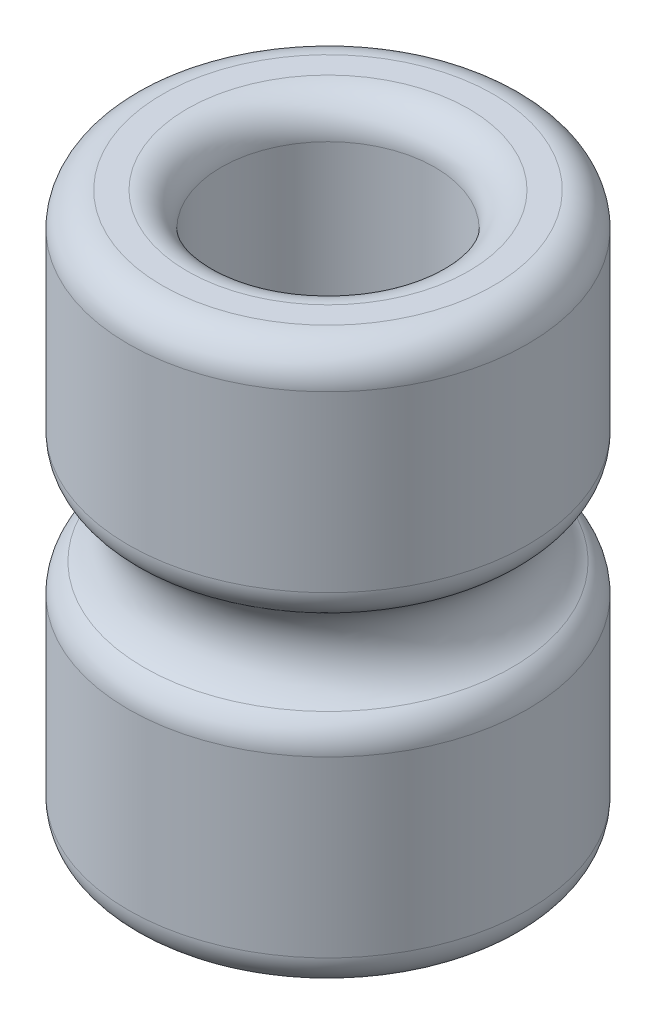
ISO-10303-21;
HEADER;
FILE_DESCRIPTION(('STEP AP214'),'2;1');
FILE_NAME('part.step','',(''),(''),'','','');
FILE_SCHEMA(('AUTOMOTIVE_DESIGN { 1 0 10303 214 1 1 1 1 }'));
ENDSEC;
DATA;
#1=APPLICATION_CONTEXT('core data for automotive mechanical design processes');
#2=APPLICATION_PROTOCOL_DEFINITION('international standard','automotive_design',2000,#1);
#3=PRODUCT_CONTEXT('',#1,'mechanical');
#4=PRODUCT('Part','Part','',(#3));
#5=PRODUCT_RELATED_PRODUCT_CATEGORY('part','',(#4));
#6=PRODUCT_DEFINITION_FORMATION('','',#4);
#7=PRODUCT_DEFINITION_CONTEXT('part definition',#1,'design');
#8=PRODUCT_DEFINITION('design','',#6,#7);
#9=PRODUCT_DEFINITION_SHAPE('','',#8);
#10=(LENGTH_UNIT() NAMED_UNIT(*) SI_UNIT(.MILLI.,.METRE.));
#11=(NAMED_UNIT(*) PLANE_ANGLE_UNIT() SI_UNIT($,.RADIAN.));
#12=(NAMED_UNIT(*) SI_UNIT($,.STERADIAN.) SOLID_ANGLE_UNIT());
#13=UNCERTAINTY_MEASURE_WITH_UNIT(LENGTH_MEASURE(1.E-05),#10,'distance_accuracy_value','');
#14=(GEOMETRIC_REPRESENTATION_CONTEXT(3) GLOBAL_UNCERTAINTY_ASSIGNED_CONTEXT((#13)) GLOBAL_UNIT_ASSIGNED_CONTEXT((#10,
#11,#12)) REPRESENTATION_CONTEXT('',''));
#15=CARTESIAN_POINT('',(0.,0.,0.));
#16=DIRECTION('',(0.,0.,1.));
#17=DIRECTION('',(1.,0.,0.));
#18=AXIS2_PLACEMENT_3D('',#15,#16,#17);
#19=CARTESIAN_POINT('',(0.,0.,0.));
#20=DIRECTION('',(0.,-1.,0.));
#21=DIRECTION('',(0.,0.,-1.));
#22=AXIS2_PLACEMENT_3D('',#19,#20,#21);
#23=CYLINDRICAL_SURFACE('',#22,2.9972);
#24=CARTESIAN_POINT('',(0.,-3.683,0.));
#25=DIRECTION('',(0.,-1.,0.));
#26=DIRECTION('',(0.,0.,-1.));
#27=AXIS2_PLACEMENT_3D('',#24,#25,#26);
#28=CIRCLE('',#27,2.9972);
#29=CARTESIAN_POINT('',(0.,-3.683,-2.9972));
#30=VERTEX_POINT('',#29);
#31=EDGE_CURVE('E50',#30,#30,#28,.F.);
#32=ORIENTED_EDGE('',*,*,#31,.T.);
#33=EDGE_LOOP('',(#32));
#34=FACE_BOUND('',#33,.T.);
#35=CARTESIAN_POINT('',(0.,-1.06891457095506,0.));
#36=DIRECTION('',(0.,-1.,0.));
#37=DIRECTION('',(0.,0.,-1.));
#38=AXIS2_PLACEMENT_3D('',#35,#36,#37);
#39=CIRCLE('',#38,2.9972);
#40=CARTESIAN_POINT('',(0.,-1.06891457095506,-2.9972));
#41=VERTEX_POINT('',#40);
#42=EDGE_CURVE('E53',#41,#41,#39,.T.);
#43=ORIENTED_EDGE('',*,*,#42,.T.);
#44=EDGE_LOOP('',(#43));
#45=FACE_BOUND('',#44,.T.);
#46=ADVANCED_FACE('F30',(#34,#45),#23,.T.);
#47=CARTESIAN_POINT('',(0.,-4.191,0.));
#48=DIRECTION('',(0.,-1.,0.));
#49=DIRECTION('',(0.,0.,-1.));
#50=AXIS2_PLACEMENT_3D('',#47,#48,#49);
#51=PLANE('',#50);
#52=CARTESIAN_POINT('',(0.,-4.191,0.));
#53=DIRECTION('',(0.,-1.,0.));
#54=DIRECTION('',(0.,0.,-1.));
#55=AXIS2_PLACEMENT_3D('',#52,#53,#54);
#56=CIRCLE('',#55,2.4892);
#57=CARTESIAN_POINT('',(0.,-4.191,-2.4892));
#58=VERTEX_POINT('',#57);
#59=EDGE_CURVE('E56',#58,#58,#56,.T.);
#60=ORIENTED_EDGE('',*,*,#59,.T.);
#61=EDGE_LOOP('',(#60));
#62=FACE_BOUND('',#61,.T.);
#63=CARTESIAN_POINT('',(0.,-4.191,0.));
#64=DIRECTION('',(0.,-1.,0.));
#65=DIRECTION('',(0.,0.,-1.));
#66=AXIS2_PLACEMENT_3D('',#63,#64,#65);
#67=CIRCLE('',#66,2.11455);
#68=CARTESIAN_POINT('',(0.,-4.191,-2.11455));
#69=VERTEX_POINT('',#68);
#70=EDGE_CURVE('E59',#69,#69,#67,.F.);
#71=ORIENTED_EDGE('',*,*,#70,.T.);
#72=EDGE_LOOP('',(#71));
#73=FACE_BOUND('',#72,.T.);
#74=ADVANCED_FACE('F85',(#62,#73),#51,.T.);
#75=CARTESIAN_POINT('',(0.,3.683,0.));
#76=DIRECTION('',(0.,1.,0.));
#77=DIRECTION('',(0.,0.,1.));
#78=AXIS2_PLACEMENT_3D('',#75,#76,#77);
#79=CIRCLE('',#78,2.9972);
#80=CARTESIAN_POINT('',(0.,3.683,2.9972));
#81=VERTEX_POINT('',#80);
#82=EDGE_CURVE('E41',#81,#81,#79,.F.);
#83=ORIENTED_EDGE('',*,*,#82,.T.);
#84=EDGE_LOOP('',(#83));
#85=FACE_BOUND('',#84,.T.);
#86=CARTESIAN_POINT('',(0.,1.06891457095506,0.));
#87=DIRECTION('',(0.,1.,0.));
#88=DIRECTION('',(0.,0.,1.));
#89=AXIS2_PLACEMENT_3D('',#86,#87,#88);
#90=CIRCLE('',#89,2.9972);
#91=CARTESIAN_POINT('',(0.,1.06891457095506,2.9972));
#92=VERTEX_POINT('',#91);
#93=EDGE_CURVE('E45',#92,#92,#90,.T.);
#94=ORIENTED_EDGE('',*,*,#93,.T.);
#95=EDGE_LOOP('',(#94));
#96=FACE_BOUND('',#95,.T.);
#97=ADVANCED_FACE('F87',(#85,#96),#23,.T.);
#98=CARTESIAN_POINT('',(0.,4.191,0.));
#99=DIRECTION('',(0.,1.,0.));
#100=DIRECTION('',(0.,0.,1.));
#101=AXIS2_PLACEMENT_3D('',#98,#99,#100);
#102=PLANE('',#101);
#103=CARTESIAN_POINT('',(0.,4.191,0.));
#104=DIRECTION('',(0.,1.,0.));
#105=DIRECTION('',(0.,0.,1.));
#106=AXIS2_PLACEMENT_3D('',#103,#104,#105);
#107=CIRCLE('',#106,2.11455);
#108=CARTESIAN_POINT('',(0.,4.191,2.11455));
#109=VERTEX_POINT('',#108);
#110=EDGE_CURVE('E62',#109,#109,#107,.F.);
#111=ORIENTED_EDGE('',*,*,#110,.T.);
#112=EDGE_LOOP('',(#111));
#113=FACE_BOUND('',#112,.T.);
#114=CARTESIAN_POINT('',(0.,4.191,0.));
#115=DIRECTION('',(0.,1.,0.));
#116=DIRECTION('',(0.,0.,1.));
#117=AXIS2_PLACEMENT_3D('',#114,#115,#116);
#118=CIRCLE('',#117,2.4892);
#119=CARTESIAN_POINT('',(0.,4.191,2.4892));
#120=VERTEX_POINT('',#119);
#121=EDGE_CURVE('E65',#120,#120,#118,.T.);
#122=ORIENTED_EDGE('',*,*,#121,.T.);
#123=EDGE_LOOP('',(#122));
#124=FACE_BOUND('',#123,.T.);
#125=ADVANCED_FACE('F94',(#113,#124),#102,.T.);
#126=CARTESIAN_POINT('',(0.,-4.191,0.));
#127=DIRECTION('',(0.,1.,0.));
#128=DIRECTION('',(0.,0.,1.));
#129=AXIS2_PLACEMENT_3D('',#126,#127,#128);
#130=CYLINDRICAL_SURFACE('',#129,1.60655);
#131=CARTESIAN_POINT('',(0.,3.683,0.));
#132=DIRECTION('',(0.,1.,0.));
#133=DIRECTION('',(0.,0.,1.));
#134=AXIS2_PLACEMENT_3D('',#131,#132,#133);
#135=CIRCLE('',#134,1.60655);
#136=CARTESIAN_POINT('',(0.,3.683,1.60655));
#137=VERTEX_POINT('',#136);
#138=EDGE_CURVE('E68',#137,#137,#135,.T.);
#139=ORIENTED_EDGE('',*,*,#138,.T.);
#140=EDGE_LOOP('',(#139));
#141=FACE_BOUND('',#140,.T.);
#142=CARTESIAN_POINT('',(0.,-3.683,0.));
#143=DIRECTION('',(0.,-1.,0.));
#144=DIRECTION('',(0.,0.,-1.));
#145=AXIS2_PLACEMENT_3D('',#142,#143,#144);
#146=CIRCLE('',#145,1.60655);
#147=CARTESIAN_POINT('',(0.,-3.683,-1.60655));
#148=VERTEX_POINT('',#147);
#149=EDGE_CURVE('E71',#148,#148,#146,.T.);
#150=ORIENTED_EDGE('',*,*,#149,.T.);
#151=EDGE_LOOP('',(#150));
#152=FACE_BOUND('',#151,.T.);
#153=ADVANCED_FACE('F75',(#141,#152),#130,.F.);
#154=CARTESIAN_POINT('',(0.,0.,0.));
#155=DIRECTION('',(0.,-1.,0.));
#156=DIRECTION('',(0.,0.,-1.));
#157=AXIS2_PLACEMENT_3D('',#154,#155,#156);
#158=TOROIDAL_SURFACE('',#157,3.175,0.762);
#159=CARTESIAN_POINT('',(0.,-0.641348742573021,0.));
#160=DIRECTION('',(0.,1.,0.));
#161=DIRECTION('',(0.,0.,1.));
#162=AXIS2_PLACEMENT_3D('',#159,#160,#161);
#163=CIRCLE('',#162,2.76352000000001);
#164=CARTESIAN_POINT('',(0.,-0.641348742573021,2.76352000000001));
#165=VERTEX_POINT('',#164);
#166=EDGE_CURVE('E10',#165,#165,#163,.T.);
#167=ORIENTED_EDGE('',*,*,#166,.T.);
#168=EDGE_LOOP('',(#167));
#169=FACE_BOUND('',#168,.T.);
#170=CARTESIAN_POINT('',(0.,0.641348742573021,0.));
#171=DIRECTION('',(0.,-1.,0.));
#172=DIRECTION('',(0.,0.,-1.));
#173=AXIS2_PLACEMENT_3D('',#170,#171,#172);
#174=CIRCLE('',#173,2.76352000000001);
#175=CARTESIAN_POINT('',(0.,0.641348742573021,-2.76352000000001));
#176=VERTEX_POINT('',#175);
#177=EDGE_CURVE('E37',#176,#176,#174,.T.);
#178=ORIENTED_EDGE('',*,*,#177,.T.);
#179=EDGE_LOOP('',(#178));
#180=FACE_BOUND('',#179,.T.);
#181=ADVANCED_FACE('F103',(#169,#180),#158,.F.);
#182=CARTESIAN_POINT('',(0.,3.683,0.));
#183=DIRECTION('',(0.,1.,0.));
#184=DIRECTION('',(0.,0.,1.));
#185=AXIS2_PLACEMENT_3D('',#182,#183,#184);
#186=TOROIDAL_SURFACE('',#185,2.11455,0.508);
#187=ORIENTED_EDGE('',*,*,#110,.F.);
#188=EDGE_LOOP('',(#187));
#189=FACE_BOUND('',#188,.T.);
#190=ORIENTED_EDGE('',*,*,#138,.F.);
#191=EDGE_LOOP('',(#190));
#192=FACE_BOUND('',#191,.T.);
#193=ADVANCED_FACE('F100',(#189,#192),#186,.T.);
#194=CARTESIAN_POINT('',(0.,-3.683,0.));
#195=DIRECTION('',(0.,-1.,0.));
#196=DIRECTION('',(0.,0.,-1.));
#197=AXIS2_PLACEMENT_3D('',#194,#195,#196);
#198=TOROIDAL_SURFACE('',#197,2.4892,0.508);
#199=ORIENTED_EDGE('',*,*,#31,.F.);
#200=EDGE_LOOP('',(#199));
#201=FACE_BOUND('',#200,.T.);
#202=ORIENTED_EDGE('',*,*,#59,.F.);
#203=EDGE_LOOP('',(#202));
#204=FACE_BOUND('',#203,.T.);
#205=ADVANCED_FACE('F81',(#201,#204),#198,.T.);
#206=CARTESIAN_POINT('',(0.,-3.683,0.));
#207=DIRECTION('',(0.,-1.,0.));
#208=DIRECTION('',(0.,0.,-1.));
#209=AXIS2_PLACEMENT_3D('',#206,#207,#208);
#210=TOROIDAL_SURFACE('',#209,2.11455,0.508);
#211=ORIENTED_EDGE('',*,*,#149,.F.);
#212=EDGE_LOOP('',(#211));
#213=FACE_BOUND('',#212,.T.);
#214=ORIENTED_EDGE('',*,*,#70,.F.);
#215=EDGE_LOOP('',(#214));
#216=FACE_BOUND('',#215,.T.);
#217=ADVANCED_FACE('F77',(#213,#216),#210,.T.);
#218=CARTESIAN_POINT('',(0.,3.683,0.));
#219=DIRECTION('',(0.,1.,0.));
#220=DIRECTION('',(0.,0.,1.));
#221=AXIS2_PLACEMENT_3D('',#218,#219,#220);
#222=TOROIDAL_SURFACE('',#221,2.4892,0.508);
#223=ORIENTED_EDGE('',*,*,#121,.F.);
#224=EDGE_LOOP('',(#223));
#225=FACE_BOUND('',#224,.T.);
#226=ORIENTED_EDGE('',*,*,#82,.F.);
#227=EDGE_LOOP('',(#226));
#228=FACE_BOUND('',#227,.T.);
#229=ADVANCED_FACE('F80',(#225,#228),#222,.T.);
#230=CARTESIAN_POINT('',(0.,-1.06891457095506,0.));
#231=DIRECTION('',(0.,-1.,0.));
#232=DIRECTION('',(0.,0.,-1.));
#233=AXIS2_PLACEMENT_3D('',#230,#231,#232);
#234=TOROIDAL_SURFACE('',#233,2.48920000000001,0.508);
#235=ORIENTED_EDGE('',*,*,#42,.F.);
#236=EDGE_LOOP('',(#235));
#237=FACE_BOUND('',#236,.T.);
#238=ORIENTED_EDGE('',*,*,#166,.F.);
#239=EDGE_LOOP('',(#238));
#240=FACE_BOUND('',#239,.T.);
#241=ADVANCED_FACE('F109',(#237,#240),#234,.T.);
#242=CARTESIAN_POINT('',(0.,1.06891457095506,0.));
#243=DIRECTION('',(0.,1.,0.));
#244=DIRECTION('',(0.,0.,1.));
#245=AXIS2_PLACEMENT_3D('',#242,#243,#244);
#246=TOROIDAL_SURFACE('',#245,2.48920000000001,0.508);
#247=ORIENTED_EDGE('',*,*,#93,.F.);
#248=EDGE_LOOP('',(#247));
#249=FACE_BOUND('',#248,.T.);
#250=ORIENTED_EDGE('',*,*,#177,.F.);
#251=EDGE_LOOP('',(#250));
#252=FACE_BOUND('',#251,.T.);
#253=ADVANCED_FACE('F32',(#249,#252),#246,.T.);
#254=CLOSED_SHELL('',(#46,#74,#97,#125,#153,#181,#193,#205,#217,#229,#241,#253));
#255=MANIFOLD_SOLID_BREP('B2',#254);
#256=ADVANCED_BREP_SHAPE_REPRESENTATION('',(#18,#255),#14);
#257=SHAPE_DEFINITION_REPRESENTATION(#9,#256);
ENDSEC;
END-ISO-10303-21;
